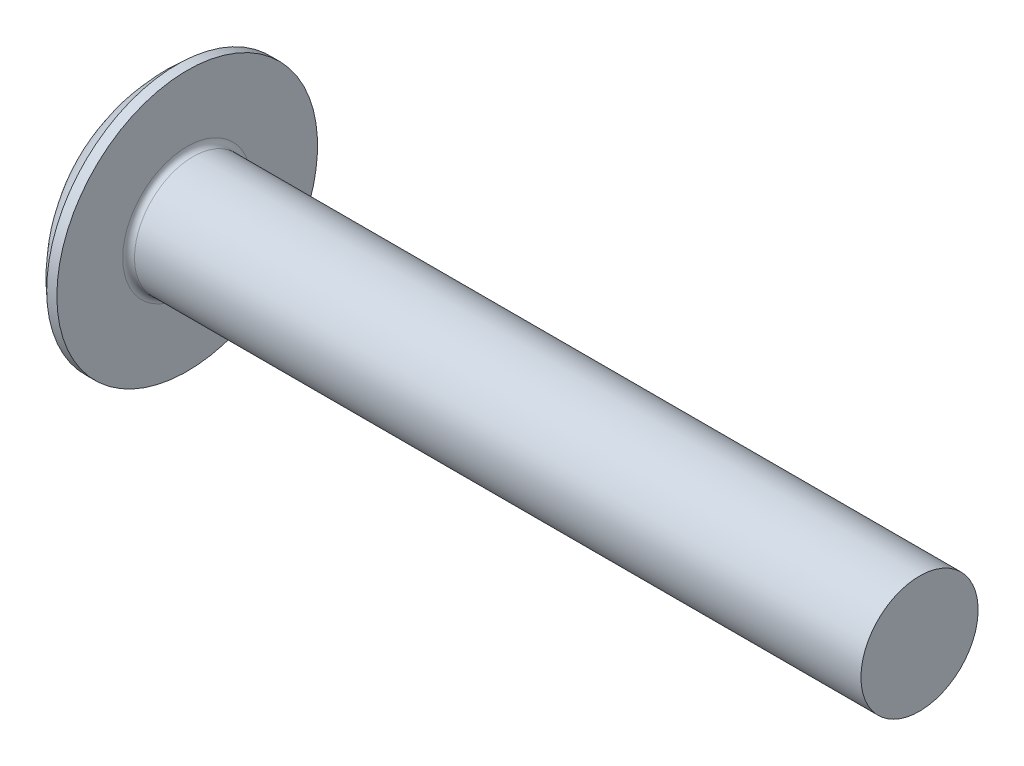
ISO-10303-21;
HEADER;
FILE_DESCRIPTION(('STEP AP214'),'2;1');
FILE_NAME('part.step','',(''),(''),'','','');
FILE_SCHEMA(('AUTOMOTIVE_DESIGN { 1 0 10303 214 1 1 1 1 }'));
ENDSEC;
DATA;
#1=APPLICATION_CONTEXT('core data for automotive mechanical design processes');
#2=APPLICATION_PROTOCOL_DEFINITION('international standard','automotive_design',2000,#1);
#3=PRODUCT_CONTEXT('',#1,'mechanical');
#4=PRODUCT('Part','Part','',(#3));
#5=PRODUCT_RELATED_PRODUCT_CATEGORY('part','',(#4));
#6=PRODUCT_DEFINITION_FORMATION('','',#4);
#7=PRODUCT_DEFINITION_CONTEXT('part definition',#1,'design');
#8=PRODUCT_DEFINITION('design','',#6,#7);
#9=PRODUCT_DEFINITION_SHAPE('','',#8);
#10=(LENGTH_UNIT() NAMED_UNIT(*) SI_UNIT(.MILLI.,.METRE.));
#11=(NAMED_UNIT(*) PLANE_ANGLE_UNIT() SI_UNIT($,.RADIAN.));
#12=(NAMED_UNIT(*) SI_UNIT($,.STERADIAN.) SOLID_ANGLE_UNIT());
#13=UNCERTAINTY_MEASURE_WITH_UNIT(LENGTH_MEASURE(1.E-05),#10,'distance_accuracy_value','');
#14=(GEOMETRIC_REPRESENTATION_CONTEXT(3) GLOBAL_UNCERTAINTY_ASSIGNED_CONTEXT((#13)) GLOBAL_UNIT_ASSIGNED_CONTEXT((#10,
#11,#12)) REPRESENTATION_CONTEXT('',''));
#15=CARTESIAN_POINT('',(0.,0.,0.));
#16=DIRECTION('',(0.,0.,1.));
#17=DIRECTION('',(1.,0.,0.));
#18=AXIS2_PLACEMENT_3D('',#15,#16,#17);
#19=CARTESIAN_POINT('',(11.7,0.,0.));
#20=DIRECTION('',(-1.,0.,0.));
#21=DIRECTION('',(0.,1.,0.));
#22=AXIS2_PLACEMENT_3D('',#19,#20,#21);
#23=SPHERICAL_SURFACE('',#22,11.7);
#24=CARTESIAN_POINT('',(4.10526498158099,0.,0.));
#25=DIRECTION('',(-1.,0.,0.));
#26=DIRECTION('',(0.,0.,1.));
#27=AXIS2_PLACEMENT_3D('',#24,#25,#26);
#28=CIRCLE('',#27,8.9);
#29=CARTESIAN_POINT('',(4.10526498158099,0.,8.9));
#30=VERTEX_POINT('',#29);
#31=EDGE_CURVE('E866',#30,#30,#28,.T.);
#32=ORIENTED_EDGE('',*,*,#31,.T.);
#33=EDGE_LOOP('',(#32));
#34=FACE_BOUND('',#33,.T.);
#35=CARTESIAN_POINT('',(0.151542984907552,0.,0.));
#36=DIRECTION('',(1.,0.,0.));
#37=DIRECTION('',(0.,0.,-1.));
#38=AXIS2_PLACEMENT_3D('',#35,#36,#37);
#39=CIRCLE('',#38,1.87700308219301);
#40=CARTESIAN_POINT('',(0.151542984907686,-0.857999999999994,-1.66942402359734));
#41=VERTEX_POINT('',#40);
#42=CARTESIAN_POINT('',(0.151542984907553,-1.66942402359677,-0.857999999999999));
#43=VERTEX_POINT('',#42);
#44=EDGE_CURVE('E628',#41,#43,#39,.F.);
#45=ORIENTED_EDGE('',*,*,#44,.F.);
#46=CARTESIAN_POINT('',(11.7,-0.858,0.));
#47=DIRECTION('',(0.,1.,0.));
#48=DIRECTION('',(0.,0.,1.));
#49=AXIS2_PLACEMENT_3D('',#46,#47,#48);
#50=CIRCLE('',#49,11.6684975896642);
#51=CARTESIAN_POINT('',(0.600864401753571,-0.857999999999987,-3.60042011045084));
#52=VERTEX_POINT('',#51);
#53=EDGE_CURVE('E537',#52,#41,#50,.T.);
#54=ORIENTED_EDGE('',*,*,#53,.F.);
#55=CARTESIAN_POINT('',(10.9279575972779,0.,1.54847776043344));
#56=DIRECTION('',(-0.446197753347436,0.,0.894934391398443));
#57=DIRECTION('',(0.894934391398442,0.,0.446197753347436));
#58=AXIS2_PLACEMENT_3D('',#55,#56,#57);
#59=CIRCLE('',#58,11.5713511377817);
#60=CARTESIAN_POINT('',(0.600864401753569,0.858000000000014,-3.60042011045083));
#61=VERTEX_POINT('',#60);
#62=EDGE_CURVE('E67',#61,#52,#59,.T.);
#63=ORIENTED_EDGE('',*,*,#62,.F.);
#64=CARTESIAN_POINT('',(11.7,0.857999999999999,0.));
#65=DIRECTION('',(0.,-1.,0.));
#66=DIRECTION('',(0.,0.,-1.));
#67=AXIS2_PLACEMENT_3D('',#64,#65,#66);
#68=CIRCLE('',#67,11.6684975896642);
#69=CARTESIAN_POINT('',(0.151542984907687,0.858000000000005,-1.66942402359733));
#70=VERTEX_POINT('',#69);
#71=EDGE_CURVE('E529',#70,#61,#68,.T.);
#72=ORIENTED_EDGE('',*,*,#71,.F.);
#73=CARTESIAN_POINT('',(0.151542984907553,1.66942402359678,-0.857999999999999));
#74=VERTEX_POINT('',#73);
#75=EDGE_CURVE('E369',#74,#70,#39,.F.);
#76=ORIENTED_EDGE('',*,*,#75,.F.);
#77=CARTESIAN_POINT('',(11.7,0.,-0.857999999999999));
#78=DIRECTION('',(0.,0.,1.));
#79=DIRECTION('',(1.,0.,0.));
#80=AXIS2_PLACEMENT_3D('',#77,#78,#79);
#81=CIRCLE('',#80,11.6684975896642);
#82=CARTESIAN_POINT('',(0.600864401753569,3.60042011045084,-0.858));
#83=VERTEX_POINT('',#82);
#84=EDGE_CURVE('E643',#83,#74,#81,.T.);
#85=ORIENTED_EDGE('',*,*,#84,.F.);
#86=CARTESIAN_POINT('',(10.9279575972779,-1.54847776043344,0.));
#87=DIRECTION('',(-0.446197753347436,-0.894934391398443,0.));
#88=DIRECTION('',(0.894934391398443,-0.446197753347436,0.));
#89=AXIS2_PLACEMENT_3D('',#86,#87,#88);
#90=CIRCLE('',#89,11.5713511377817);
#91=CARTESIAN_POINT('',(0.600864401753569,3.60042011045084,0.858));
#92=VERTEX_POINT('',#91);
#93=EDGE_CURVE('E644',#92,#83,#90,.T.);
#94=ORIENTED_EDGE('',*,*,#93,.F.);
#95=CARTESIAN_POINT('',(11.7,0.,0.858));
#96=DIRECTION('',(0.,0.,-1.));
#97=DIRECTION('',(0.,1.,0.));
#98=AXIS2_PLACEMENT_3D('',#95,#96,#97);
#99=CIRCLE('',#98,11.6684975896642);
#100=CARTESIAN_POINT('',(0.151542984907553,1.66942402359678,0.858));
#101=VERTEX_POINT('',#100);
#102=EDGE_CURVE('E83',#101,#92,#99,.T.);
#103=ORIENTED_EDGE('',*,*,#102,.F.);
#104=CARTESIAN_POINT('',(0.151542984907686,0.857999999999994,1.66942402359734));
#105=VERTEX_POINT('',#104);
#106=EDGE_CURVE('E605',#105,#101,#39,.F.);
#107=ORIENTED_EDGE('',*,*,#106,.F.);
#108=CARTESIAN_POINT('',(0.600864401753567,0.857999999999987,3.60042011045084));
#109=VERTEX_POINT('',#108);
#110=EDGE_CURVE('E541',#109,#105,#68,.T.);
#111=ORIENTED_EDGE('',*,*,#110,.F.);
#112=CARTESIAN_POINT('',(10.9279575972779,0.,-1.54847776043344));
#113=DIRECTION('',(-0.446197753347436,0.,-0.894934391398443));
#114=DIRECTION('',(-0.894934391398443,0.,0.446197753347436));
#115=AXIS2_PLACEMENT_3D('',#112,#113,#114);
#116=CIRCLE('',#115,11.5713511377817);
#117=CARTESIAN_POINT('',(0.600864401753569,-0.858000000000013,3.60042011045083));
#118=VERTEX_POINT('',#117);
#119=EDGE_CURVE('E655',#118,#109,#116,.T.);
#120=ORIENTED_EDGE('',*,*,#119,.F.);
#121=CARTESIAN_POINT('',(0.151542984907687,-0.858000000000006,1.66942402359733));
#122=VERTEX_POINT('',#121);
#123=EDGE_CURVE('E540',#122,#118,#50,.T.);
#124=ORIENTED_EDGE('',*,*,#123,.F.);
#125=CARTESIAN_POINT('',(0.151542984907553,-1.66942402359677,0.858));
#126=VERTEX_POINT('',#125);
#127=EDGE_CURVE('E625',#126,#122,#39,.F.);
#128=ORIENTED_EDGE('',*,*,#127,.F.);
#129=CARTESIAN_POINT('',(0.600864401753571,-3.60042011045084,0.858));
#130=VERTEX_POINT('',#129);
#131=EDGE_CURVE('E651',#130,#126,#99,.T.);
#132=ORIENTED_EDGE('',*,*,#131,.F.);
#133=CARTESIAN_POINT('',(10.9279575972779,1.54847776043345,0.));
#134=DIRECTION('',(-0.446197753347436,0.894934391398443,0.));
#135=DIRECTION('',(-0.894934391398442,-0.446197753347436,0.));
#136=AXIS2_PLACEMENT_3D('',#133,#134,#135);
#137=CIRCLE('',#136,11.5713511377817);
#138=CARTESIAN_POINT('',(0.600864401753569,-3.60042011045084,-0.858000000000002));
#139=VERTEX_POINT('',#138);
#140=EDGE_CURVE('E642',#139,#130,#137,.T.);
#141=ORIENTED_EDGE('',*,*,#140,.F.);
#142=EDGE_CURVE('E640',#43,#139,#81,.T.);
#143=ORIENTED_EDGE('',*,*,#142,.F.);
#144=EDGE_LOOP('',(#45,#54,#63,#72,#76,#85,#94,#103,#107,#111,#120,#124,#128,#132,#141,#143));
#145=FACE_BOUND('',#144,.T.);
#146=ADVANCED_FACE('F57',(#34,#145),#23,.T.);
#147=CARTESIAN_POINT('',(4.36,-1.72618455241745,0.858));
#148=DIRECTION('',(0.,0.,-1.));
#149=DIRECTION('',(0.,1.,0.));
#150=AXIS2_PLACEMENT_3D('',#147,#148,#149);
#151=PLANE('',#150);
#152=ORIENTED_EDGE('',*,*,#131,.T.);
#153=CARTESIAN_POINT('',(0.0628651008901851,-1.67639299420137,0.858));
#154=CARTESIAN_POINT('',(0.647863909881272,-1.63041566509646,0.858));
#155=CARTESIAN_POINT('',(1.23283620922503,-1.58409115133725,0.858));
#156=CARTESIAN_POINT('',(2.40269761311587,-1.49042264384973,0.858));
#157=CARTESIAN_POINT('',(2.98758671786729,-1.44307865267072,0.858));
#158=CARTESIAN_POINT('',(3.83502530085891,-1.37350171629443,0.858));
#159=CARTESIAN_POINT('',(4.09761886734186,-1.35180560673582,0.858));
#160=CARTESIAN_POINT('',(4.3602,-1.32995920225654,0.858));
#161=B_SPLINE_CURVE_WITH_KNOTS('',3,(#153,#154,#155,#156,#157,#158,#159,#160),.UNSPECIFIED.,.F.,
.F.,(4,2,2,4),(0.,1.76040955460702,3.52081470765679,4.31127962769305),.UNSPECIFIED.);
#162=CARTESIAN_POINT('',(4.36,-1.32997584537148,0.858000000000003));
#163=VERTEX_POINT('',#162);
#164=EDGE_CURVE('E629',#126,#163,#161,.T.);
#165=ORIENTED_EDGE('',*,*,#164,.T.);
#166=DIRECTION('',(0.,-1.,0.));
#167=VECTOR('',#166,1.);
#168=CARTESIAN_POINT('',(4.36,1.72618455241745,0.858));
#169=LINE('',#168,#167);
#170=CARTESIAN_POINT('',(4.36,-1.72618455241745,0.858));
#171=VERTEX_POINT('',#170);
#172=EDGE_CURVE('E418',#163,#171,#169,.T.);
#173=ORIENTED_EDGE('',*,*,#172,.T.);
#174=DIRECTION('',(0.894934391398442,0.446197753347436,0.));
#175=VECTOR('',#174,1.);
#176=CARTESIAN_POINT('',(0.,-3.9,0.858));
#177=LINE('',#176,#175);
#178=EDGE_CURVE('E553',#130,#171,#177,.T.);
#179=ORIENTED_EDGE('',*,*,#178,.F.);
#180=EDGE_LOOP('',(#152,#165,#173,#179));
#181=FACE_BOUND('',#180,.T.);
#182=ADVANCED_FACE('F187',(#181),#151,.T.);
#183=CARTESIAN_POINT('',(4.36,1.72618455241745,0.858));
#184=VERTEX_POINT('',#183);
#185=CARTESIAN_POINT('',(4.36,1.32997584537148,0.858000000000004));
#186=VERTEX_POINT('',#185);
#187=EDGE_CURVE('E572',#184,#186,#169,.T.);
#188=ORIENTED_EDGE('',*,*,#187,.T.);
#189=CARTESIAN_POINT('',(4.3602,1.32995920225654,0.858));
#190=CARTESIAN_POINT('',(3.8687290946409,1.3708438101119,0.858));
#191=CARTESIAN_POINT('',(3.37721503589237,1.41120541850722,0.858));
#192=CARTESIAN_POINT('',(2.39411826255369,1.49107412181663,0.858));
#193=CARTESIAN_POINT('',(1.90253554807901,1.53058121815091,0.858));
#194=CARTESIAN_POINT('',(1.1862600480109,1.58766023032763,0.858));
#195=CARTESIAN_POINT('',(0.961588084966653,1.60549436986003,0.858));
#196=CARTESIAN_POINT('',(0.512233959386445,1.64103586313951,0.858));
#197=CARTESIAN_POINT('',(0.287551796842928,1.65874321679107,0.858));
#198=CARTESIAN_POINT('',(0.0628651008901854,1.67639299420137,0.858));
#199=B_SPLINE_CURVE_WITH_KNOTS('',3,(#189,#190,#191,#192,#193,#194,#195,#196,#197,#198),
.UNSPECIFIED.,.F.,.F.,(4,2,2,2,4),(0.,1.47950483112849,2.9590072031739,3.63514321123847,
4.3112797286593),.UNSPECIFIED.);
#200=EDGE_CURVE('E624',#186,#101,#199,.T.);
#201=ORIENTED_EDGE('',*,*,#200,.T.);
#202=ORIENTED_EDGE('',*,*,#102,.T.);
#203=DIRECTION('',(0.894934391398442,-0.446197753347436,0.));
#204=VECTOR('',#203,1.);
#205=CARTESIAN_POINT('',(0.,3.9,0.858));
#206=LINE('',#205,#204);
#207=EDGE_CURVE('E550',#92,#184,#206,.T.);
#208=ORIENTED_EDGE('',*,*,#207,.T.);
#209=EDGE_LOOP('',(#188,#201,#202,#208));
#210=FACE_BOUND('',#209,.T.);
#211=ADVANCED_FACE('F193',(#210),#151,.T.);
#212=CARTESIAN_POINT('',(4.36,1.72618455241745,-0.858));
#213=DIRECTION('',(0.,0.,1.));
#214=DIRECTION('',(1.,0.,0.));
#215=AXIS2_PLACEMENT_3D('',#212,#213,#214);
#216=PLANE('',#215);
#217=DIRECTION('',(0.,1.,0.));
#218=VECTOR('',#217,1.);
#219=CARTESIAN_POINT('',(4.36,1.72618455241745,-0.858));
#220=LINE('',#219,#218);
#221=CARTESIAN_POINT('',(4.36,-1.72618455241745,-0.858));
#222=VERTEX_POINT('',#221);
#223=CARTESIAN_POINT('',(4.36,-1.32997584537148,-0.858000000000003));
#224=VERTEX_POINT('',#223);
#225=EDGE_CURVE('E570',#222,#224,#220,.T.);
#226=ORIENTED_EDGE('',*,*,#225,.T.);
#227=CARTESIAN_POINT('',(4.3602,-1.32995920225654,-0.858));
#228=CARTESIAN_POINT('',(3.8687290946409,-1.3708438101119,-0.858));
#229=CARTESIAN_POINT('',(3.37721503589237,-1.41120541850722,-0.858));
#230=CARTESIAN_POINT('',(2.39411826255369,-1.49107412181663,-0.858));
#231=CARTESIAN_POINT('',(1.902535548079,-1.53058121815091,-0.858));
#232=CARTESIAN_POINT('',(1.1862600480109,-1.58766023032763,-0.858));
#233=CARTESIAN_POINT('',(0.961588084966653,-1.60549436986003,-0.858));
#234=CARTESIAN_POINT('',(0.512233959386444,-1.64103586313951,-0.858));
#235=CARTESIAN_POINT('',(0.287551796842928,-1.65874321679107,-0.858));
#236=CARTESIAN_POINT('',(0.0628651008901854,-1.67639299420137,-0.858));
#237=B_SPLINE_CURVE_WITH_KNOTS('',3,(#227,#228,#229,#230,#231,#232,#233,#234,#235,#236),
.UNSPECIFIED.,.F.,.F.,(4,2,2,2,4),(0.,1.47950483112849,2.9590072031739,3.63514321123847,
4.3112797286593),.UNSPECIFIED.);
#238=EDGE_CURVE('E633',#224,#43,#237,.T.);
#239=ORIENTED_EDGE('',*,*,#238,.T.);
#240=ORIENTED_EDGE('',*,*,#142,.T.);
#241=DIRECTION('',(0.894934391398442,0.446197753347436,0.));
#242=VECTOR('',#241,1.);
#243=CARTESIAN_POINT('',(0.,-3.9,-0.858000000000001));
#244=LINE('',#243,#242);
#245=EDGE_CURVE('E549',#139,#222,#244,.T.);
#246=ORIENTED_EDGE('',*,*,#245,.T.);
#247=EDGE_LOOP('',(#226,#239,#240,#246));
#248=FACE_BOUND('',#247,.T.);
#249=ADVANCED_FACE('F378',(#248),#216,.T.);
#250=ORIENTED_EDGE('',*,*,#84,.T.);
#251=CARTESIAN_POINT('',(0.0628651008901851,1.67639299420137,-0.858));
#252=CARTESIAN_POINT('',(0.647863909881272,1.63041566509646,-0.858));
#253=CARTESIAN_POINT('',(1.23283620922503,1.58409115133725,-0.858));
#254=CARTESIAN_POINT('',(2.40269761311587,1.49042264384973,-0.858));
#255=CARTESIAN_POINT('',(2.98758671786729,1.44307865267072,-0.858));
#256=CARTESIAN_POINT('',(3.83502530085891,1.37350171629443,-0.858));
#257=CARTESIAN_POINT('',(4.09761886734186,1.35180560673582,-0.858));
#258=CARTESIAN_POINT('',(4.3602,1.32995920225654,-0.858));
#259=B_SPLINE_CURVE_WITH_KNOTS('',3,(#251,#252,#253,#254,#255,#256,#257,#258),.UNSPECIFIED.,.F.,
.F.,(4,2,2,4),(0.,1.76040955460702,3.52081470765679,4.31127962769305),.UNSPECIFIED.);
#260=CARTESIAN_POINT('',(4.36,1.32997584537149,-0.858000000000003));
#261=VERTEX_POINT('',#260);
#262=EDGE_CURVE('E366',#74,#261,#259,.T.);
#263=ORIENTED_EDGE('',*,*,#262,.T.);
#264=CARTESIAN_POINT('',(4.36,1.72618455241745,-0.858));
#265=VERTEX_POINT('',#264);
#266=EDGE_CURVE('E406',#261,#265,#220,.T.);
#267=ORIENTED_EDGE('',*,*,#266,.T.);
#268=DIRECTION('',(0.894934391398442,-0.446197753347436,0.));
#269=VECTOR('',#268,1.);
#270=CARTESIAN_POINT('',(0.,3.9,-0.858));
#271=LINE('',#270,#269);
#272=EDGE_CURVE('E547',#83,#265,#271,.T.);
#273=ORIENTED_EDGE('',*,*,#272,.F.);
#274=EDGE_LOOP('',(#250,#263,#267,#273));
#275=FACE_BOUND('',#274,.T.);
#276=ADVANCED_FACE('F221',(#275),#216,.T.);
#277=CARTESIAN_POINT('',(4.36,1.72618455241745,0.858));
#278=DIRECTION('',(1.,0.,0.));
#279=DIRECTION('',(0.,0.,-1.));
#280=AXIS2_PLACEMENT_3D('',#277,#278,#279);
#281=PLANE('',#280);
#282=CARTESIAN_POINT('',(4.36,0.,0.));
#283=DIRECTION('',(-1.,0.,0.));
#284=DIRECTION('',(0.,0.,1.));
#285=AXIS2_PLACEMENT_3D('',#282,#283,#284);
#286=CIRCLE('',#285,1.58271909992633);
#287=EDGE_CURVE('E581',#224,#163,#286,.T.);
#288=ORIENTED_EDGE('',*,*,#287,.F.);
#289=ORIENTED_EDGE('',*,*,#225,.F.);
#290=DIRECTION('',(0.,0.,-1.));
#291=VECTOR('',#290,1.);
#292=CARTESIAN_POINT('',(4.36,-1.72618455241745,0.858));
#293=LINE('',#292,#291);
#294=EDGE_CURVE('E437',#171,#222,#293,.T.);
#295=ORIENTED_EDGE('',*,*,#294,.F.);
#296=ORIENTED_EDGE('',*,*,#172,.F.);
#297=EDGE_LOOP('',(#288,#289,#295,#296));
#298=FACE_BOUND('',#297,.T.);
#299=ADVANCED_FACE('F216',(#298),#281,.F.);
#300=CARTESIAN_POINT('',(4.36,-0.858000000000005,1.32997584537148));
#301=VERTEX_POINT('',#300);
#302=CARTESIAN_POINT('',(4.36,0.857999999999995,1.32997584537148));
#303=VERTEX_POINT('',#302);
#304=EDGE_CURVE('E597',#301,#303,#286,.T.);
#305=ORIENTED_EDGE('',*,*,#304,.F.);
#306=DIRECTION('',(0.,0.,-1.));
#307=VECTOR('',#306,1.);
#308=CARTESIAN_POINT('',(4.36,-0.858000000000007,1.72618455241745));
#309=LINE('',#308,#307);
#310=CARTESIAN_POINT('',(4.36,-0.858000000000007,1.72618455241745));
#311=VERTEX_POINT('',#310);
#312=EDGE_CURVE('E61',#311,#301,#309,.T.);
#313=ORIENTED_EDGE('',*,*,#312,.F.);
#314=DIRECTION('',(0.,-1.,0.));
#315=VECTOR('',#314,1.);
#316=CARTESIAN_POINT('',(4.36,-0.858000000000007,1.72618455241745));
#317=LINE('',#316,#315);
#318=CARTESIAN_POINT('',(4.36,0.857999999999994,1.72618455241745));
#319=VERTEX_POINT('',#318);
#320=EDGE_CURVE('E510',#319,#311,#317,.T.);
#321=ORIENTED_EDGE('',*,*,#320,.F.);
#322=DIRECTION('',(0.,0.,1.));
#323=VECTOR('',#322,1.);
#324=CARTESIAN_POINT('',(4.36,0.857999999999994,1.72618455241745));
#325=LINE('',#324,#323);
#326=EDGE_CURVE('E295',#303,#319,#325,.T.);
#327=ORIENTED_EDGE('',*,*,#326,.F.);
#328=EDGE_LOOP('',(#305,#313,#321,#327));
#329=FACE_BOUND('',#328,.T.);
#330=ADVANCED_FACE('F220',(#329),#281,.F.);
#331=EDGE_CURVE('E575',#186,#261,#286,.T.);
#332=ORIENTED_EDGE('',*,*,#331,.F.);
#333=ORIENTED_EDGE('',*,*,#187,.F.);
#334=DIRECTION('',(0.,0.,1.));
#335=VECTOR('',#334,1.);
#336=CARTESIAN_POINT('',(4.36,1.72618455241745,0.858));
#337=LINE('',#336,#335);
#338=EDGE_CURVE('E560',#265,#184,#337,.T.);
#339=ORIENTED_EDGE('',*,*,#338,.F.);
#340=ORIENTED_EDGE('',*,*,#266,.F.);
#341=EDGE_LOOP('',(#332,#333,#339,#340));
#342=FACE_BOUND('',#341,.T.);
#343=ADVANCED_FACE('F573',(#342),#281,.F.);
#344=CARTESIAN_POINT('',(4.36,0.858000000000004,-1.32997584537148));
#345=VERTEX_POINT('',#344);
#346=CARTESIAN_POINT('',(4.36,-0.857999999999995,-1.32997584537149));
#347=VERTEX_POINT('',#346);
#348=EDGE_CURVE('E506',#345,#347,#286,.T.);
#349=ORIENTED_EDGE('',*,*,#348,.F.);
#350=CARTESIAN_POINT('',(4.36,0.858000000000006,-1.72618455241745));
#351=VERTEX_POINT('',#350);
#352=EDGE_CURVE('E503',#351,#345,#325,.T.);
#353=ORIENTED_EDGE('',*,*,#352,.F.);
#354=DIRECTION('',(0.,1.,0.));
#355=VECTOR('',#354,1.);
#356=CARTESIAN_POINT('',(4.36,-0.857999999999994,-1.72618455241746));
#357=LINE('',#356,#355);
#358=CARTESIAN_POINT('',(4.36,-0.857999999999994,-1.72618455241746));
#359=VERTEX_POINT('',#358);
#360=EDGE_CURVE('E504',#359,#351,#357,.T.);
#361=ORIENTED_EDGE('',*,*,#360,.F.);
#362=EDGE_CURVE('E368',#347,#359,#309,.T.);
#363=ORIENTED_EDGE('',*,*,#362,.F.);
#364=EDGE_LOOP('',(#349,#353,#361,#363));
#365=FACE_BOUND('',#364,.T.);
#366=ADVANCED_FACE('F223',(#365),#281,.F.);
#367=CARTESIAN_POINT('',(4.36,0.857999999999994,1.72618455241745));
#368=DIRECTION('',(0.,-1.,0.));
#369=DIRECTION('',(1.,0.,0.));
#370=AXIS2_PLACEMENT_3D('',#367,#368,#369);
#371=PLANE('',#370);
#372=ORIENTED_EDGE('',*,*,#352,.T.);
#373=CARTESIAN_POINT('',(4.3602,0.858000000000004,-1.32995920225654));
#374=CARTESIAN_POINT('',(3.8687290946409,0.858000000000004,-1.3708438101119));
#375=CARTESIAN_POINT('',(3.37721503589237,0.858000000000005,-1.41120541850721));
#376=CARTESIAN_POINT('',(2.39411826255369,0.858000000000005,-1.49107412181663));
#377=CARTESIAN_POINT('',(1.90253554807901,0.858000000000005,-1.5305812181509));
#378=CARTESIAN_POINT('',(1.1862600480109,0.858000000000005,-1.58766023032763));
#379=CARTESIAN_POINT('',(0.961588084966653,0.858000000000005,-1.60549436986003));
#380=CARTESIAN_POINT('',(0.512233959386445,0.858000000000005,-1.64103586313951));
#381=CARTESIAN_POINT('',(0.287551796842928,0.858000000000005,-1.65874321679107));
#382=CARTESIAN_POINT('',(0.0628651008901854,0.858000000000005,-1.67639299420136));
#383=B_SPLINE_CURVE_WITH_KNOTS('',3,(#373,#374,#375,#376,#377,#378,#379,#380,#381,#382),
.UNSPECIFIED.,.F.,.F.,(4,2,2,2,4),(0.,1.47950483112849,2.9590072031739,3.63514321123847,
4.3112797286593),.UNSPECIFIED.);
#384=EDGE_CURVE('E365',#345,#70,#383,.T.);
#385=ORIENTED_EDGE('',*,*,#384,.T.);
#386=ORIENTED_EDGE('',*,*,#71,.T.);
#387=DIRECTION('',(0.894934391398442,0.,0.446197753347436));
#388=VECTOR('',#387,1.);
#389=CARTESIAN_POINT('',(0.,0.858000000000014,-3.9));
#390=LINE('',#389,#388);
#391=EDGE_CURVE('E515',#61,#351,#390,.T.);
#392=ORIENTED_EDGE('',*,*,#391,.T.);
#393=EDGE_LOOP('',(#372,#385,#386,#392));
#394=FACE_BOUND('',#393,.T.);
#395=ADVANCED_FACE('F306',(#394),#371,.T.);
#396=CARTESIAN_POINT('',(4.36,-0.857999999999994,-1.72618455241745));
#397=DIRECTION('',(0.,1.,0.));
#398=DIRECTION('',(0.,0.,1.));
#399=AXIS2_PLACEMENT_3D('',#396,#397,#398);
#400=PLANE('',#399);
#401=ORIENTED_EDGE('',*,*,#53,.T.);
#402=CARTESIAN_POINT('',(0.0628651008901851,-0.857999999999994,-1.67639299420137));
#403=CARTESIAN_POINT('',(0.647863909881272,-0.857999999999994,-1.63041566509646));
#404=CARTESIAN_POINT('',(1.23283620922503,-0.857999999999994,-1.58409115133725));
#405=CARTESIAN_POINT('',(2.40269761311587,-0.857999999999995,-1.49042264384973));
#406=CARTESIAN_POINT('',(2.98758671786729,-0.857999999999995,-1.44307865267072));
#407=CARTESIAN_POINT('',(3.83502530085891,-0.857999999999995,-1.37350171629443));
#408=CARTESIAN_POINT('',(4.09761886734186,-0.857999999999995,-1.35180560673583));
#409=CARTESIAN_POINT('',(4.3602,-0.857999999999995,-1.32995920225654));
#410=B_SPLINE_CURVE_WITH_KNOTS('',3,(#402,#403,#404,#405,#406,#407,#408,#409),.UNSPECIFIED.,.F.,
.F.,(4,2,2,4),(0.,1.76040955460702,3.52081470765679,4.31127962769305),.UNSPECIFIED.);
#411=EDGE_CURVE('E632',#41,#347,#410,.T.);
#412=ORIENTED_EDGE('',*,*,#411,.T.);
#413=ORIENTED_EDGE('',*,*,#362,.T.);
#414=DIRECTION('',(0.894934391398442,0.,0.446197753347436));
#415=VECTOR('',#414,1.);
#416=CARTESIAN_POINT('',(0.,-0.857999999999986,-3.9));
#417=LINE('',#416,#415);
#418=EDGE_CURVE('E518',#52,#359,#417,.T.);
#419=ORIENTED_EDGE('',*,*,#418,.F.);
#420=EDGE_LOOP('',(#401,#412,#413,#419));
#421=FACE_BOUND('',#420,.T.);
#422=ADVANCED_FACE('F474',(#421),#400,.T.);
#423=ORIENTED_EDGE('',*,*,#312,.T.);
#424=CARTESIAN_POINT('',(4.3602,-0.858000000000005,1.32995920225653));
#425=CARTESIAN_POINT('',(3.8687290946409,-0.858000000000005,1.3708438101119));
#426=CARTESIAN_POINT('',(3.37721503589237,-0.858000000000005,1.41120541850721));
#427=CARTESIAN_POINT('',(2.39411826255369,-0.858000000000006,1.49107412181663));
#428=CARTESIAN_POINT('',(1.90253554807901,-0.858000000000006,1.5305812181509));
#429=CARTESIAN_POINT('',(1.1862600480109,-0.858000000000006,1.58766023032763));
#430=CARTESIAN_POINT('',(0.961588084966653,-0.858000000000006,1.60549436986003));
#431=CARTESIAN_POINT('',(0.512233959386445,-0.858000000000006,1.64103586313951));
#432=CARTESIAN_POINT('',(0.287551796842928,-0.858000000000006,1.65874321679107));
#433=CARTESIAN_POINT('',(0.0628651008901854,-0.858000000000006,1.67639299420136));
#434=B_SPLINE_CURVE_WITH_KNOTS('',3,(#424,#425,#426,#427,#428,#429,#430,#431,#432,#433),
.UNSPECIFIED.,.F.,.F.,(4,2,2,2,4),(0.,1.47950483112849,2.9590072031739,3.63514321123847,
4.3112797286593),.UNSPECIFIED.);
#435=EDGE_CURVE('E627',#301,#122,#434,.T.);
#436=ORIENTED_EDGE('',*,*,#435,.T.);
#437=ORIENTED_EDGE('',*,*,#123,.T.);
#438=DIRECTION('',(0.894934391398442,0.,-0.446197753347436));
#439=VECTOR('',#438,1.);
#440=CARTESIAN_POINT('',(0.,-0.858000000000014,3.9));
#441=LINE('',#440,#439);
#442=EDGE_CURVE('E527',#118,#311,#441,.T.);
#443=ORIENTED_EDGE('',*,*,#442,.T.);
#444=EDGE_LOOP('',(#423,#436,#437,#443));
#445=FACE_BOUND('',#444,.T.);
#446=ADVANCED_FACE('F482',(#445),#400,.T.);
#447=ORIENTED_EDGE('',*,*,#110,.T.);
#448=CARTESIAN_POINT('',(0.0628651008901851,0.857999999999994,1.67639299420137));
#449=CARTESIAN_POINT('',(0.647863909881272,0.857999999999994,1.63041566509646));
#450=CARTESIAN_POINT('',(1.23283620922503,0.857999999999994,1.58409115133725));
#451=CARTESIAN_POINT('',(2.40269761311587,0.857999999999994,1.49042264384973));
#452=CARTESIAN_POINT('',(2.98758671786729,0.857999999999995,1.44307865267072));
#453=CARTESIAN_POINT('',(3.83502530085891,0.857999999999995,1.37350171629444));
#454=CARTESIAN_POINT('',(4.09761886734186,0.857999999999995,1.35180560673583));
#455=CARTESIAN_POINT('',(4.3602,0.857999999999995,1.32995920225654));
#456=B_SPLINE_CURVE_WITH_KNOTS('',3,(#448,#449,#450,#451,#452,#453,#454,#455),.UNSPECIFIED.,.F.,
.F.,(4,2,2,4),(0.,1.76040955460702,3.52081470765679,4.31127962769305),.UNSPECIFIED.);
#457=EDGE_CURVE('E12',#105,#303,#456,.T.);
#458=ORIENTED_EDGE('',*,*,#457,.T.);
#459=ORIENTED_EDGE('',*,*,#326,.T.);
#460=DIRECTION('',(0.894934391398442,0.,-0.446197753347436));
#461=VECTOR('',#460,1.);
#462=CARTESIAN_POINT('',(0.,0.857999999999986,3.9));
#463=LINE('',#462,#461);
#464=EDGE_CURVE('E524',#109,#319,#463,.T.);
#465=ORIENTED_EDGE('',*,*,#464,.F.);
#466=EDGE_LOOP('',(#447,#458,#459,#465));
#467=FACE_BOUND('',#466,.T.);
#468=ADVANCED_FACE('F203',(#467),#371,.T.);
#469=CARTESIAN_POINT('',(0.,0.,0.));
#470=DIRECTION('',(-1.,0.,0.));
#471=DIRECTION('',(0.,0.,1.));
#472=AXIS2_PLACEMENT_3D('',#469,#470,#471);
#473=CYLINDRICAL_SURFACE('',#472,8.9);
#474=ORIENTED_EDGE('',*,*,#31,.F.);
#475=EDGE_LOOP('',(#474));
#476=FACE_BOUND('',#475,.T.);
#477=CARTESIAN_POINT('',(4.8,0.,0.));
#478=DIRECTION('',(-1.,0.,0.));
#479=DIRECTION('',(0.,0.,1.));
#480=AXIS2_PLACEMENT_3D('',#477,#478,#479);
#481=CIRCLE('',#480,8.9);
#482=CARTESIAN_POINT('',(4.8,0.,8.9));
#483=VERTEX_POINT('',#482);
#484=EDGE_CURVE('E868',#483,#483,#481,.T.);
#485=ORIENTED_EDGE('',*,*,#484,.T.);
#486=EDGE_LOOP('',(#485));
#487=FACE_BOUND('',#486,.T.);
#488=ADVANCED_FACE('F199',(#476,#487),#473,.T.);
#489=CARTESIAN_POINT('',(4.8,4.,0.));
#490=DIRECTION('',(-1.,0.,0.));
#491=DIRECTION('',(0.,0.,1.));
#492=AXIS2_PLACEMENT_3D('',#489,#490,#491);
#493=PLANE('',#492);
#494=CARTESIAN_POINT('',(4.8,0.,0.));
#495=DIRECTION('',(-1.,0.,0.));
#496=DIRECTION('',(0.,0.,1.));
#497=AXIS2_PLACEMENT_3D('',#494,#495,#496);
#498=CIRCLE('',#497,4.4);
#499=CARTESIAN_POINT('',(4.8,0.,4.4));
#500=VERTEX_POINT('',#499);
#501=EDGE_CURVE('E865',#500,#500,#498,.T.);
#502=ORIENTED_EDGE('',*,*,#501,.T.);
#503=EDGE_LOOP('',(#502));
#504=FACE_BOUND('',#503,.T.);
#505=ORIENTED_EDGE('',*,*,#484,.F.);
#506=EDGE_LOOP('',(#505));
#507=FACE_BOUND('',#506,.T.);
#508=ADVANCED_FACE('F202',(#504,#507),#493,.F.);
#509=CARTESIAN_POINT('',(0.,0.,0.));
#510=DIRECTION('',(-1.,0.,0.));
#511=DIRECTION('',(0.,0.,1.));
#512=AXIS2_PLACEMENT_3D('',#509,#510,#511);
#513=CYLINDRICAL_SURFACE('',#512,4.);
#514=CARTESIAN_POINT('',(5.2,0.,0.));
#515=DIRECTION('',(-1.,0.,0.));
#516=DIRECTION('',(0.,0.,1.));
#517=AXIS2_PLACEMENT_3D('',#514,#515,#516);
#518=CIRCLE('',#517,4.);
#519=CARTESIAN_POINT('',(5.2,0.,4.));
#520=VERTEX_POINT('',#519);
#521=EDGE_CURVE('E647',#520,#520,#518,.F.);
#522=ORIENTED_EDGE('',*,*,#521,.T.);
#523=EDGE_LOOP('',(#522));
#524=FACE_BOUND('',#523,.T.);
#525=CARTESIAN_POINT('',(54.8,0.,0.));
#526=DIRECTION('',(-1.,0.,0.));
#527=DIRECTION('',(0.,0.,1.));
#528=AXIS2_PLACEMENT_3D('',#525,#526,#527);
#529=CIRCLE('',#528,4.);
#530=CARTESIAN_POINT('',(54.8,0.,4.));
#531=VERTEX_POINT('',#530);
#532=EDGE_CURVE('E872',#531,#531,#529,.T.);
#533=ORIENTED_EDGE('',*,*,#532,.T.);
#534=EDGE_LOOP('',(#533));
#535=FACE_BOUND('',#534,.T.);
#536=ADVANCED_FACE('F207',(#524,#535),#513,.T.);
#537=CARTESIAN_POINT('',(54.8,4.,0.));
#538=DIRECTION('',(-1.,0.,0.));
#539=DIRECTION('',(0.,0.,1.));
#540=AXIS2_PLACEMENT_3D('',#537,#538,#539);
#541=PLANE('',#540);
#542=ORIENTED_EDGE('',*,*,#532,.F.);
#543=EDGE_LOOP('',(#542));
#544=FACE_BOUND('',#543,.T.);
#545=ADVANCED_FACE('F211',(#544),#541,.F.);
#546=CARTESIAN_POINT('',(5.2,0.,0.));
#547=DIRECTION('',(-1.,0.,0.));
#548=DIRECTION('',(0.,0.,1.));
#549=AXIS2_PLACEMENT_3D('',#546,#547,#548);
#550=TOROIDAL_SURFACE('',#549,4.4,0.4);
#551=ORIENTED_EDGE('',*,*,#521,.F.);
#552=EDGE_LOOP('',(#551));
#553=FACE_BOUND('',#552,.T.);
#554=ORIENTED_EDGE('',*,*,#501,.F.);
#555=EDGE_LOOP('',(#554));
#556=FACE_BOUND('',#555,.T.);
#557=ADVANCED_FACE('F59',(#553,#556),#550,.F.);
#558=CARTESIAN_POINT('',(4.36,-1.72618455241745,-0.858));
#559=DIRECTION('',(-0.446197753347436,0.894934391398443,0.));
#560=DIRECTION('',(-0.894934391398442,-0.446197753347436,0.));
#561=AXIS2_PLACEMENT_3D('',#558,#559,#560);
#562=PLANE('',#561);
#563=ORIENTED_EDGE('',*,*,#140,.T.);
#564=ORIENTED_EDGE('',*,*,#178,.T.);
#565=ORIENTED_EDGE('',*,*,#294,.T.);
#566=ORIENTED_EDGE('',*,*,#245,.F.);
#567=EDGE_LOOP('',(#563,#564,#565,#566));
#568=FACE_BOUND('',#567,.T.);
#569=ADVANCED_FACE('F440',(#568),#562,.T.);
#570=CARTESIAN_POINT('',(4.36,1.72618455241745,0.858));
#571=DIRECTION('',(-0.446197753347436,-0.894934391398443,0.));
#572=DIRECTION('',(0.894934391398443,-0.446197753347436,0.));
#573=AXIS2_PLACEMENT_3D('',#570,#571,#572);
#574=PLANE('',#573);
#575=ORIENTED_EDGE('',*,*,#93,.T.);
#576=ORIENTED_EDGE('',*,*,#272,.T.);
#577=ORIENTED_EDGE('',*,*,#338,.T.);
#578=ORIENTED_EDGE('',*,*,#207,.F.);
#579=EDGE_LOOP('',(#575,#576,#577,#578));
#580=FACE_BOUND('',#579,.T.);
#581=ADVANCED_FACE('F224',(#580),#574,.T.);
#582=CARTESIAN_POINT('',(4.36,0.858000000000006,-1.72618455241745));
#583=DIRECTION('',(-0.446197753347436,0.,0.894934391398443));
#584=DIRECTION('',(-0.894934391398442,0.,-0.446197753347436));
#585=AXIS2_PLACEMENT_3D('',#582,#583,#584);
#586=PLANE('',#585);
#587=ORIENTED_EDGE('',*,*,#62,.T.);
#588=ORIENTED_EDGE('',*,*,#418,.T.);
#589=ORIENTED_EDGE('',*,*,#360,.T.);
#590=ORIENTED_EDGE('',*,*,#391,.F.);
#591=EDGE_LOOP('',(#587,#588,#589,#590));
#592=FACE_BOUND('',#591,.T.);
#593=ADVANCED_FACE('F312',(#592),#586,.T.);
#594=CARTESIAN_POINT('',(4.36,-0.858000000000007,1.72618455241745));
#595=DIRECTION('',(-0.446197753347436,0.,-0.894934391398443));
#596=DIRECTION('',(0.894934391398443,0.,-0.446197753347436));
#597=AXIS2_PLACEMENT_3D('',#594,#595,#596);
#598=PLANE('',#597);
#599=ORIENTED_EDGE('',*,*,#119,.T.);
#600=ORIENTED_EDGE('',*,*,#464,.T.);
#601=ORIENTED_EDGE('',*,*,#320,.T.);
#602=ORIENTED_EDGE('',*,*,#442,.F.);
#603=EDGE_LOOP('',(#599,#600,#601,#602));
#604=FACE_BOUND('',#603,.T.);
#605=ADVANCED_FACE('F448',(#604),#598,.T.);
#606=CARTESIAN_POINT('',(4.36,0.,0.));
#607=DIRECTION('',(-1.,0.,0.));
#608=DIRECTION('',(0.,0.,1.));
#609=AXIS2_PLACEMENT_3D('',#606,#607,#608);
#610=CONICAL_SURFACE('',#609,1.58271909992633,0.0698131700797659);
#611=ORIENTED_EDGE('',*,*,#75,.T.);
#612=ORIENTED_EDGE('',*,*,#384,.F.);
#613=EDGE_CURVE('E615',#261,#345,#286,.T.);
#614=ORIENTED_EDGE('',*,*,#613,.F.);
#615=ORIENTED_EDGE('',*,*,#262,.F.);
#616=EDGE_LOOP('',(#611,#612,#614,#615));
#617=FACE_BOUND('',#616,.T.);
#618=ADVANCED_FACE('F185',(#617),#610,.F.);
#619=EDGE_CURVE('E620',#347,#224,#286,.T.);
#620=ORIENTED_EDGE('',*,*,#619,.F.);
#621=ORIENTED_EDGE('',*,*,#411,.F.);
#622=ORIENTED_EDGE('',*,*,#44,.T.);
#623=ORIENTED_EDGE('',*,*,#238,.F.);
#624=EDGE_LOOP('',(#620,#621,#622,#623));
#625=FACE_BOUND('',#624,.T.);
#626=ADVANCED_FACE('F637',(#625),#610,.F.);
#627=ORIENTED_EDGE('',*,*,#127,.T.);
#628=ORIENTED_EDGE('',*,*,#435,.F.);
#629=EDGE_CURVE('E599',#163,#301,#286,.T.);
#630=ORIENTED_EDGE('',*,*,#629,.F.);
#631=ORIENTED_EDGE('',*,*,#164,.F.);
#632=EDGE_LOOP('',(#627,#628,#630,#631));
#633=FACE_BOUND('',#632,.T.);
#634=ADVANCED_FACE('F183',(#633),#610,.F.);
#635=EDGE_CURVE('E75',#303,#186,#286,.T.);
#636=ORIENTED_EDGE('',*,*,#635,.F.);
#637=ORIENTED_EDGE('',*,*,#457,.F.);
#638=ORIENTED_EDGE('',*,*,#106,.T.);
#639=ORIENTED_EDGE('',*,*,#200,.F.);
#640=EDGE_LOOP('',(#636,#637,#638,#639));
#641=FACE_BOUND('',#640,.T.);
#642=ADVANCED_FACE('F177',(#641),#610,.F.);
#643=CARTESIAN_POINT('',(4.87425660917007,0.,0.));
#644=DIRECTION('',(-1.,0.,0.));
#645=DIRECTION('',(0.,0.,1.));
#646=AXIS2_PLACEMENT_3D('',#643,#644,#645);
#647=CONICAL_SURFACE('',#646,0.,1.25663706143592);
#648=ORIENTED_EDGE('',*,*,#635,.T.);
#649=ORIENTED_EDGE('',*,*,#331,.T.);
#650=ORIENTED_EDGE('',*,*,#613,.T.);
#651=ORIENTED_EDGE('',*,*,#348,.T.);
#652=ORIENTED_EDGE('',*,*,#619,.T.);
#653=ORIENTED_EDGE('',*,*,#287,.T.);
#654=ORIENTED_EDGE('',*,*,#629,.T.);
#655=ORIENTED_EDGE('',*,*,#304,.T.);
#656=EDGE_LOOP('',(#648,#649,#650,#651,#652,#653,#654,#655));
#657=FACE_BOUND('',#656,.T.);
#658=CARTESIAN_POINT('',(4.87425660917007,0.,0.));
#659=VERTEX_POINT('',#658);
#660=VERTEX_LOOP('',#659);
#661=FACE_BOUND('',#660,.T.);
#662=ADVANCED_FACE('F175',(#657,#661),#647,.F.);
#663=CLOSED_SHELL('',(#146,#182,#211,#249,#276,#299,#330,#343,#366,#395,#422,#446,#468,#488,
#508,#536,#545,#557,#569,#581,#593,#605,#618,#626,#634,#642,#662));
#664=MANIFOLD_SOLID_BREP('B2',#663);
#665=ADVANCED_BREP_SHAPE_REPRESENTATION('',(#18,#664),#14);
#666=SHAPE_DEFINITION_REPRESENTATION(#9,#665);
ENDSEC;
END-ISO-10303-21;
